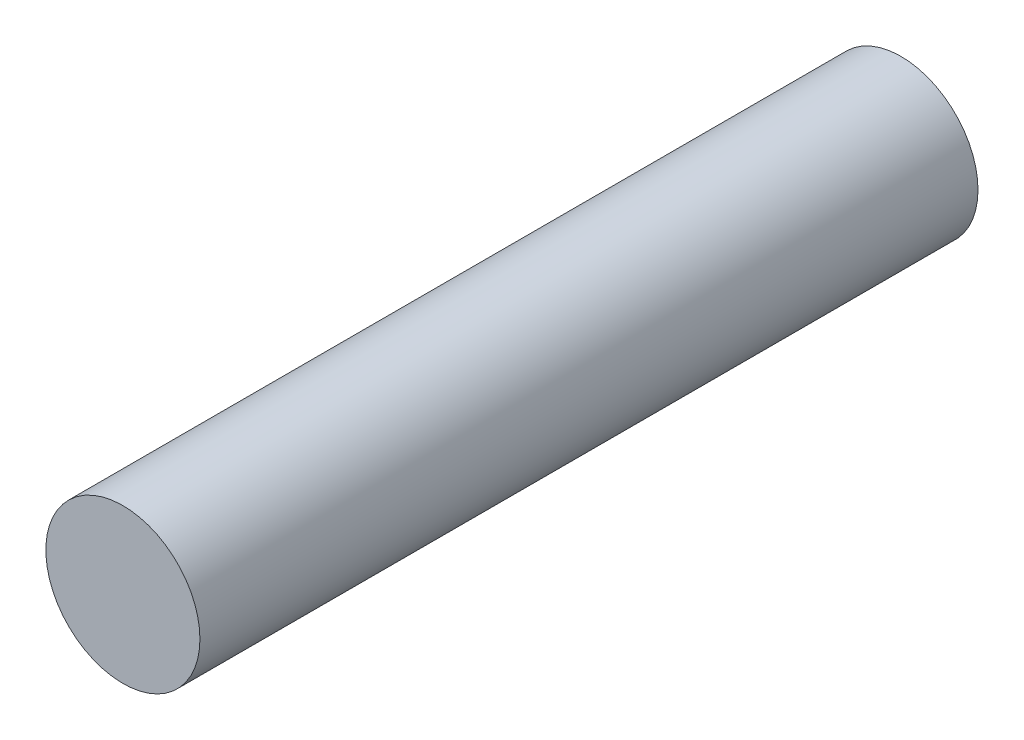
ISO-10303-21;
HEADER;
FILE_DESCRIPTION(('STEP AP214'),'2;1');
FILE_NAME('part.step','',(''),(''),'','','');
FILE_SCHEMA(('AUTOMOTIVE_DESIGN { 1 0 10303 214 1 1 1 1 }'));
ENDSEC;
DATA;
#1=APPLICATION_CONTEXT('core data for automotive mechanical design processes');
#2=APPLICATION_PROTOCOL_DEFINITION('international standard','automotive_design',2000,#1);
#3=PRODUCT_CONTEXT('',#1,'mechanical');
#4=PRODUCT('Part','Part','',(#3));
#5=PRODUCT_RELATED_PRODUCT_CATEGORY('part','',(#4));
#6=PRODUCT_DEFINITION_FORMATION('','',#4);
#7=PRODUCT_DEFINITION_CONTEXT('part definition',#1,'design');
#8=PRODUCT_DEFINITION('design','',#6,#7);
#9=PRODUCT_DEFINITION_SHAPE('','',#8);
#10=(LENGTH_UNIT() NAMED_UNIT(*) SI_UNIT(.MILLI.,.METRE.));
#11=(NAMED_UNIT(*) PLANE_ANGLE_UNIT() SI_UNIT($,.RADIAN.));
#12=(NAMED_UNIT(*) SI_UNIT($,.STERADIAN.) SOLID_ANGLE_UNIT());
#13=UNCERTAINTY_MEASURE_WITH_UNIT(LENGTH_MEASURE(1.E-05),#10,'distance_accuracy_value','');
#14=(GEOMETRIC_REPRESENTATION_CONTEXT(3) GLOBAL_UNCERTAINTY_ASSIGNED_CONTEXT((#13)) GLOBAL_UNIT_ASSIGNED_CONTEXT((#10,
#11,#12)) REPRESENTATION_CONTEXT('',''));
#15=CARTESIAN_POINT('',(0.,0.,0.));
#16=DIRECTION('',(0.,0.,1.));
#17=DIRECTION('',(1.,0.,0.));
#18=AXIS2_PLACEMENT_3D('',#15,#16,#17);
#19=CARTESIAN_POINT('',(0.,0.,110.));
#20=DIRECTION('',(0.,0.,-1.));
#21=DIRECTION('',(-1.,0.,0.));
#22=AXIS2_PLACEMENT_3D('',#19,#20,#21);
#23=CYLINDRICAL_SURFACE('',#22,10.8918227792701);
#24=CARTESIAN_POINT('',(0.,0.,110.));
#25=DIRECTION('',(0.,0.,1.));
#26=DIRECTION('',(1.,0.,0.));
#27=AXIS2_PLACEMENT_3D('',#24,#25,#26);
#28=CIRCLE('',#27,10.8918227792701);
#29=CARTESIAN_POINT('',(10.8918227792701,0.,110.));
#30=VERTEX_POINT('',#29);
#31=EDGE_CURVE('E10',#30,#30,#28,.T.);
#32=ORIENTED_EDGE('',*,*,#31,.F.);
#33=EDGE_LOOP('',(#32));
#34=FACE_BOUND('',#33,.T.);
#35=CARTESIAN_POINT('',(0.,0.,0.));
#36=DIRECTION('',(0.,0.,1.));
#37=DIRECTION('',(1.,0.,0.));
#38=AXIS2_PLACEMENT_3D('',#35,#36,#37);
#39=CIRCLE('',#38,10.8918227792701);
#40=CARTESIAN_POINT('',(10.8918227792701,0.,0.));
#41=VERTEX_POINT('',#40);
#42=EDGE_CURVE('E34',#41,#41,#39,.T.);
#43=ORIENTED_EDGE('',*,*,#42,.T.);
#44=EDGE_LOOP('',(#43));
#45=FACE_BOUND('',#44,.T.);
#46=ADVANCED_FACE('F31',(#34,#45),#23,.T.);
#47=CARTESIAN_POINT('',(0.,0.,110.));
#48=DIRECTION('',(0.,0.,1.));
#49=DIRECTION('',(1.,0.,0.));
#50=AXIS2_PLACEMENT_3D('',#47,#48,#49);
#51=PLANE('',#50);
#52=ORIENTED_EDGE('',*,*,#31,.T.);
#53=EDGE_LOOP('',(#52));
#54=FACE_BOUND('',#53,.T.);
#55=ADVANCED_FACE('F46',(#54),#51,.T.);
#56=CARTESIAN_POINT('',(0.,0.,0.));
#57=DIRECTION('',(0.,0.,1.));
#58=DIRECTION('',(1.,0.,0.));
#59=AXIS2_PLACEMENT_3D('',#56,#57,#58);
#60=PLANE('',#59);
#61=ORIENTED_EDGE('',*,*,#42,.F.);
#62=EDGE_LOOP('',(#61));
#63=FACE_BOUND('',#62,.T.);
#64=ADVANCED_FACE('F44',(#63),#60,.F.);
#65=CLOSED_SHELL('',(#46,#55,#64));
#66=MANIFOLD_SOLID_BREP('B2',#65);
#67=ADVANCED_BREP_SHAPE_REPRESENTATION('',(#18,#66),#14);
#68=SHAPE_DEFINITION_REPRESENTATION(#9,#67);
ENDSEC;
END-ISO-10303-21;
